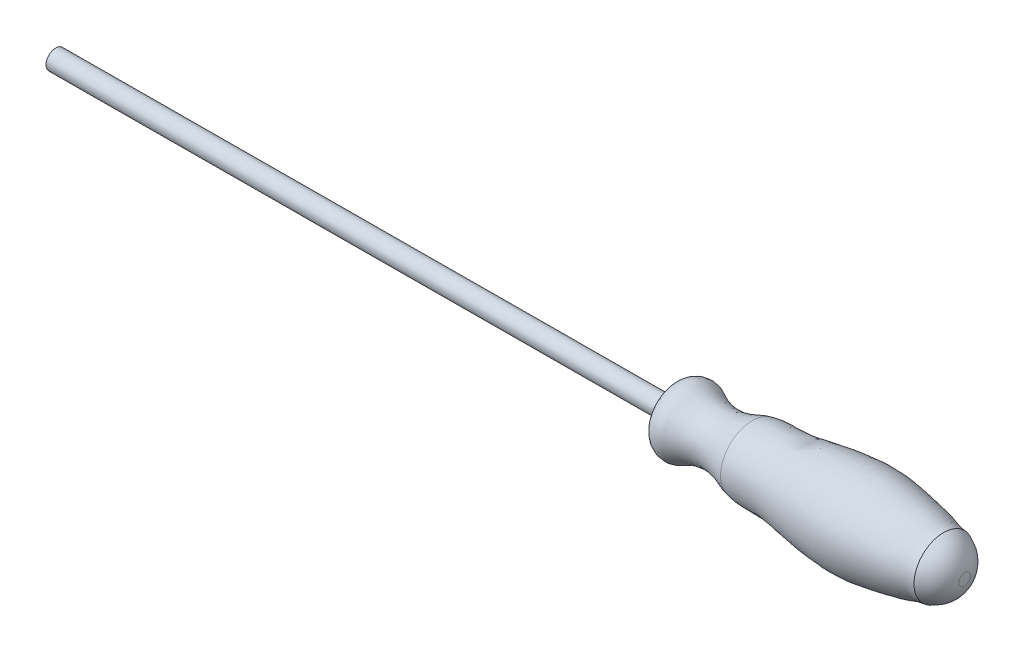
from build123d import *

# Parameters (mm, degrees)
ESQUISSE3_R        = 3.75
BOSS_EXTRU_1_DEPTH = 240


with BuildPart() as part:
    # Esquisse1 → R_volution2 (revolve)
    with BuildSketch(Plane.XY):
        with BuildLine():
            Line((0, 0), (0, -3.401426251))
            add(Edge.make_bspline(
                [(0, -3.401426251), (-0.155626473, -7.164391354), (0.545364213, -10.877495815)],
                knots=[0, 0, 0, 1, 1, 1], degree=2))
            add(Edge.make_bspline(
                [(0.545364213, -10.877495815), (1.370348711, -11.974386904), (3.322599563, -12.830240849), (6.1946299, -12.924419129), (8.217292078, -11.885870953), (10.513673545, -10.674466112), (13.281514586, -9.808697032), (16.63195169, -9.223476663), (20.26291873, -9.325960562), (24.156837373, -10.163375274), (27.190596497, -11.558728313), (29.163277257, -12.059936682), (29.777909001, -12.206134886)],
                knots=[0, 0, 0, 0, 0.120356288, 0.182103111, 0.252493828, 0.320379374, 0.416926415, 0.511670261, 0.625759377, 0.741661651, 0.867963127, 0.924773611, 0.924773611, 0.924773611, 0.924773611], degree=3))
            add(Edge.make_bspline(
                [(29.777909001, -12.206134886), (31.13461791, -12.450353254), (33.16756523, -12.891149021), (36.387648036, -12.905092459), (39.171536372, -12.879877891), (42.625903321, -12.979104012), (46.218046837, -13.346962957), (49.916730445, -14.006778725), (53.621808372, -14.640491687), (57.266189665, -15.174429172), (61.120160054, -15.681235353), (65.140508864, -15.997601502), (69.272038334, -16.421387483), (73.606560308, -16.352122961), (77.783899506, -16.21619251), (81.990209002, -15.531584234), (86.314059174, -14.803957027), (91.847427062, -13.851504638), (97.750889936, -12.539019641), (101.929439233, -10.960357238), (103.818425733, -10.988192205)],
                knots=[0, 0, 0, 0, 0.055398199, 0.08267741, 0.128818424, 0.167035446, 0.221096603, 0.273333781, 0.317568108, 0.371733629, 0.42094103, 0.473294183, 0.533363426, 0.587167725, 0.646878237, 0.700631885, 0.757710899, 0.822668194, 0.925588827, 1, 1, 1, 1], degree=3))
            add(Edge.make_bspline(
                [(103.818425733, -10.988192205), (105.386632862, -10.395573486), (109.210159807, -8.226972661), (111.462986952, -4.230800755), (111.92227912, -1.652205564)],
                knots=[0, 0, 0, 0, 0.390825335, 1, 1, 1, 1], degree=3))
            add(Edge.make_bspline(
                [(112, 0.541102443), (112.005297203, -0.555338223), (111.92227912, -1.652205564)],
                knots=[0.5, 0.5, 0.5, 1, 1, 1], degree=2))
            Line((112, 0.541102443), (0, 0))
        make_face()
    revolve(axis=Axis((0, 0, 0), (0.9999883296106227, 0.0048312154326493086, 0)))

    # Esquisse3 → Boss.-Extru.1 (add)
    with BuildSketch(Plane(origin=(-0.016432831, -7.9391e-05, 0), x_dir=(0, 0, -1), z_dir=(0.9999883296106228, 0.004831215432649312, 0))):
        with Locations(Location((0, 0, 0), (0, 0, 90))):
            Circle(ESQUISSE3_R)
    extrude(amount=-BOSS_EXTRU_1_DEPTH)


solid = part.part
